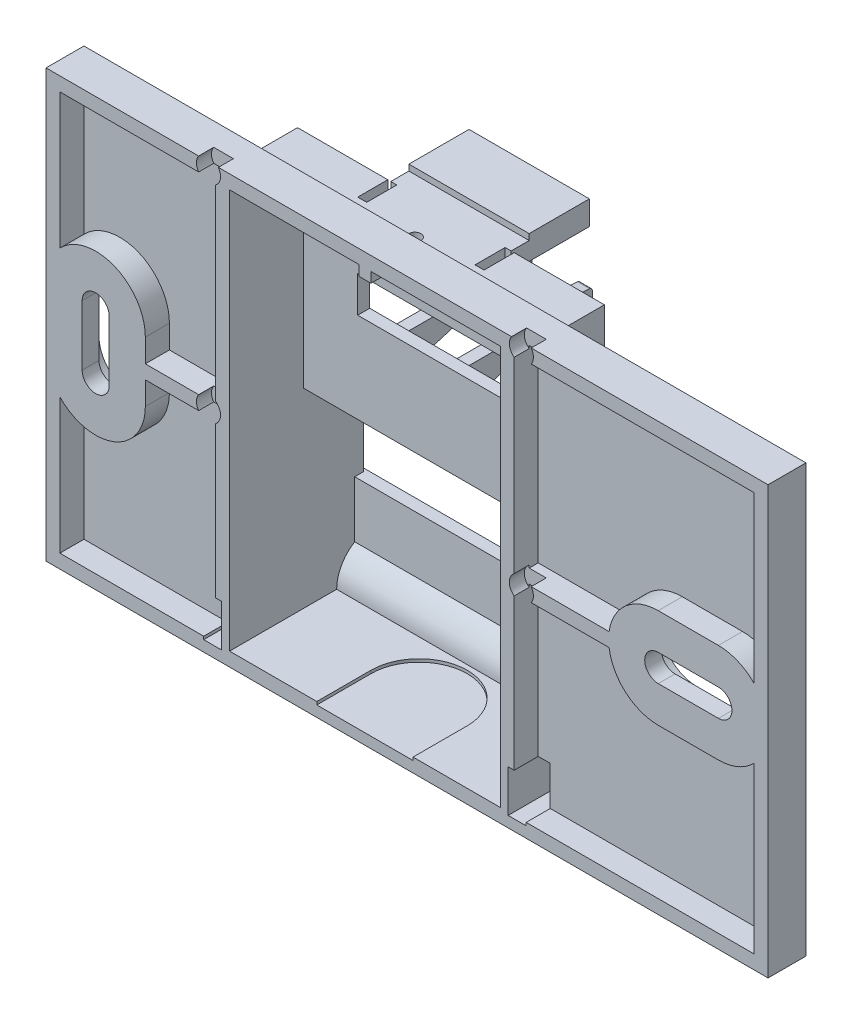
from build123d import *

# Parameters (mm, degrees)
ESQUISSE1_W                    = 120
ESQUISSE1_H                    = 71
EXTRUSION1_DEPTH               = 2.3
ESQUISSE2_W                    = 45
ESQUISSE2_H                    = 66.4
EXTRUSION2_DEPTH               = 4
ESQUISSE3_W                    = 45
ESQUISSE3_H                    = 66.4
ENL_V_MAT_EXTRU_1_DEPTH        = 98.703633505
ENL_V_MAT_EXTRU_2_DEPTH        = 3.5
ESQUISSE5_R                    = 2
ENL_V_MAT_EXTRU_3_DEPTH        = 2.5
ESQUISSE6_W                    = 51
ESQUISSE6_H                    = 69
ESQUISSE6_W_2                  = 45
ESQUISSE6_H_2                  = 64.7
EXTRUSION3_DEPTH               = 16
ESQUISSE7_W                    = 1.5
ESQUISSE7_H                    = 17
ENL_V_MAT_EXTRU_4_DEPTH        = 108.047886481
EXTRUSION4_START               = -3
EXTRUSION4_DEPTH               = 51
EXTRUSION5_REACH               = 91.323
EXTRUSION5_END_RADIUS          = 6.25
ESQUISSE9_W                    = 51
ESQUISSE9_H                    = 2
ESQUISSE10_W                   = 8
ESQUISSE10_H                   = 26.5
ENL_V_MAT_EXTRU_5_DEPTH        = 120.041112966
ESQUISSE11_W                   = 51
ESQUISSE11_H                   = 2
EXTRUSION6_DEPTH               = 33
ESQUISSE12_W                   = 27
ESQUISSE12_H                   = 6
ESQUISSE12_W_2                 = 22.5
ESQUISSE12_H_2                 = 4
ENL_V_MAT_EXTRU_6_DEPTH        = 100.258012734
ESQUISSE13_R                   = 1
ESQUISSE13_W                   = 1.5
ESQUISSE13_H                   = 5
ENL_V_MAT_EXTRU_7_DEPTH        = 3
EXTRUSION8_DEPTH               = 10
ESQUISSE15_W                   = 3
ESQUISSE15_H                   = 7
ENL_V_MAT_EXTRU_8_DEPTH        = 7
ENL_V_MAT_EXTRU_9_DEPTH        = 0.5
ESQUISSE17_W                   = 2
ESQUISSE17_H                   = 6.3
EXTRUSION9_DEPTH               = 1.7
EXTRUSION10_DEPTH              = 1
CONG_1_R                       = 0.5
R_P_TITION_LIN_AIRE1_COUNT     = 2
R_P_TITION_LIN_AIRE1_PITCH     = 10
R_P_TITION_LIN_AIRE1_COL_COUNT = 2
R_P_TITION_LIN_AIRE1_COL_PITCH = 10
CONG_2_R                       = 0.5


with BuildPart() as part:
    # Esquisse1 → Extrusion1 (new body)
    with BuildSketch(Plane.XY):
        with Locations((7, -35.5)):
            Rectangle(ESQUISSE1_W, ESQUISSE1_H)
    extrude(amount=EXTRUSION1_DEPTH)

    # Esquisse2 → Extrusion2 (add)
    with BuildSketch(Plane.XY.offset(2.3)):
        Polygon((-53, 0), (67, 0), (67, -71), (-53, -71), (-53, -30.5), align=None)
        with BuildLine():
            Line((-50.7, -2.3), (-50.7, -24.785107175))
            ThreePointArc((-50.7, -24.785107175), (-41.669821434, -22.846569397), (-36.5, -30.5))
            Line((-36.5, -30.5), (-36.5, -34.35))
            Line((-36.5, -34.35), (-24.8, -34.35))
            Line((-24.8, -34.35), (-24.8, -2.3))
            Line((-24.8, -2.3), (-50.7, -2.3))
        make_face(mode=Mode.SUBTRACT)
        with BuildLine():
            Line((-50.7, -68.7), (-24.8, -68.7))
            Line((-24.8, -68.7), (-24.8, -36.65))
            Line((-24.8, -36.65), (-36.5, -36.65))
            Line((-36.5, -36.65), (-36.5, -40.5))
            ThreePointArc((-36.5, -40.5), (-41.669821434, -48.153430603), (-50.7, -46.214892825))
            Line((-50.7, -46.214892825), (-50.7, -68.7))
        make_face(mode=Mode.SUBTRACT)
        with BuildLine():
            Line((64.7, -2.3), (64.7, -29.785107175))
            ThreePointArc((64.7, -29.785107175), (61.983777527, -27.91019217), (58.75, -27.25))
            Line((58.75, -27.25), (48.75, -27.25))
            ThreePointArc((48.75, -27.25), (43.338207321, -29.273042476), (40.580544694, -34.35))
            Line((40.580544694, -34.35), (24.8, -34.35))
            Line((24.8, -34.35), (24.8, -2.3))
            Line((24.8, -2.3), (64.7, -2.3))
        make_face(mode=Mode.SUBTRACT)
        with Locations((0, -35.5)):
            Rectangle(ESQUISSE2_W, ESQUISSE2_H, mode=Mode.SUBTRACT)
        with BuildLine():
            Line((24.8, -68.7), (64.7, -68.7))
            Line((64.7, -68.7), (64.7, -41.214892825))
            ThreePointArc((64.7, -41.214892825), (61.983777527, -43.08980783), (58.75, -43.75))
            Line((58.75, -43.75), (48.75, -43.75))
            ThreePointArc((48.75, -43.75), (43.338207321, -41.726957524), (40.580544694, -36.65))
            Line((40.580544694, -36.65), (24.8, -36.65))
            Line((24.8, -36.65), (24.8, -68.7))
        make_face(mode=Mode.SUBTRACT)
        with BuildLine():
            Line((-47, -40.5), (-47, -30.5))
            ThreePointArc((-47, -30.5), (-44.75, -28.25), (-42.5, -30.5))
            Line((-42.5, -30.5), (-42.5, -40.5))
            ThreePointArc((-42.5, -40.5), (-44.75, -42.75), (-47, -40.5))
        make_face(mode=Mode.SUBTRACT)
        with BuildLine():
            Line((48.75, -33.25), (58.75, -33.25))
            ThreePointArc((58.75, -33.25), (61, -35.5), (58.75, -37.75))
            Line((58.75, -37.75), (48.75, -37.75))
            ThreePointArc((48.75, -37.75), (46.5, -35.5), (48.75, -33.25))
        make_face(mode=Mode.SUBTRACT)
    extrude(amount=EXTRUSION2_DEPTH)

    # Esquisse3 → Enl_v. mat.-Extru.1 (cut, through all)
    with BuildSketch(Plane.XY.offset(2.3)):
        with Locations((0, -35.5)):
            Rectangle(ESQUISSE3_W, ESQUISSE3_H)
    extrude(amount=-ENL_V_MAT_EXTRU_1_DEPTH, mode=Mode.SUBTRACT)

    # Esquisse4 → Enl_v. mat.-Extru.2 (cut)
    with BuildSketch(Plane(origin=(0, 0, 0), x_dir=(-1, 0, 0), z_dir=(0, 0, -1))):
        with BuildLine():
            Line((39, -30.5), (39, -40.5))
            ThreePointArc((39, -40.5), (44.75, -46.25), (50.5, -40.5))
            Line((50.5, -40.5), (50.5, -30.5))
            ThreePointArc((50.5, -30.5), (44.75, -24.75), (39, -30.5))
        make_face()
        with BuildLine():
            Line((-48.75, -29.75), (-58.75, -29.75))
            ThreePointArc((-58.75, -29.75), (-64.5, -35.5), (-58.75, -41.25))
            Line((-58.75, -41.25), (-48.75, -41.25))
            ThreePointArc((-48.75, -41.25), (-43, -35.5), (-48.75, -29.75))
        make_face()
    extrude(amount=-ENL_V_MAT_EXTRU_2_DEPTH, mode=Mode.SUBTRACT)

    # Esquisse5 → Enl_v. mat.-Extru.3 (cut)
    with BuildSketch(Plane.XY.offset(6.3)):
        with Locations((-26, -1.15)):
            Circle(ESQUISSE5_R)
        with Locations((-26, -35.500929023)):
            Circle(ESQUISSE5_R)
        with Locations((26, -35.500929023)):
            Circle(ESQUISSE5_R)
        with Locations((26, -1.15)):
            Circle(ESQUISSE5_R)
    extrude(amount=-ENL_V_MAT_EXTRU_3_DEPTH, mode=Mode.SUBTRACT)

    # Esquisse6 → Extrusion3 (add)
    with BuildSketch(Plane(origin=(0, 0, 0), x_dir=(-1, 0, 0), z_dir=(0, 0, -1))):
        with Locations((0, -36.5)):
            Rectangle(ESQUISSE6_W, ESQUISSE6_H)
        with Locations((0, -36.35)):
            Rectangle(ESQUISSE6_W_2, ESQUISSE6_H_2, mode=Mode.SUBTRACT)
    extrude(amount=EXTRUSION3_DEPTH)

    # Esquisse7 → Enl_v. mat.-Extru.4 (cut, through all)
    with BuildSketch(Plane(origin=(25.5, 0, 0), x_dir=(0, 0, -1), z_dir=(1, 0, 0))):
        with Locations((15.25, -62.5)):
            Rectangle(ESQUISSE7_W, ESQUISSE7_H)
    extrude(amount=-ENL_V_MAT_EXTRU_4_DEPTH, mode=Mode.SUBTRACT)

    # Esquisse8 → Extrusion4 (add)
    with BuildSketch(Plane.ZY.offset(-22.5).offset(EXTRUSION4_START)):
        with BuildLine():
            Line((-23.198623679, -68.7), (-21.679058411, -68.7))
            ThreePointArc((-21.679058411, -68.7), (-21.201025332, -68.527913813), (-20.942359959, -68.090625))
            ThreePointArc((-20.942359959, -68.090625), (-17.44395251, -65.464442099), (-14.5, -68.7))
            Line((-14.5, -68.7), (-14.5, -71))
            Line((-14.5, -71), (-11.5, -71))
            Line((-11.5, -71), (-11.5, -68.7))
            ThreePointArc((-11.5, -68.7), (-17.322864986, -62.464612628), (-23.941617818, -67.847727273))
            ThreePointArc((-23.941617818, -67.847727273), (-23.763957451, -68.442846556), (-23.198623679, -68.7))
        make_face()
    extrude(amount=EXTRUSION4_DEPTH)

    # Extrusion5: up to this cylinder (the profile starts outside it)
    extrusion5_end = Plane(origin=(0, -68.7, -17.75), z_dir=(1, 0, 0)) * Cylinder(EXTRUSION5_END_RADIUS, 196.146, mode=Mode.PRIVATE)
    # Esquisse9 → Extrusion5 (add, up to the surface)
    with BuildSketch(Plane.XZ.offset(54), mode=Mode.PRIVATE) as extrusion5_sk1:
        with Locations((0, -15.5)):
            Rectangle(ESQUISSE9_W, ESQUISSE9_H)
    extrusion5_tool1 = extrude(extrusion5_sk1.sketch, amount=EXTRUSION5_REACH, mode=Mode.PRIVATE) - extrusion5_end
    add(extrusion5_tool1.solids().sort_by_distance((0, -54, -15.5))[0])

    # Esquisse10 → Enl_v. mat.-Extru.5 (cut, through all)
    with BuildSketch(Plane.ZY.offset(25.5)):
        with Locations((-12, -15.25)):
            Rectangle(ESQUISSE10_W, ESQUISSE10_H)
    extrude(amount=-ENL_V_MAT_EXTRU_5_DEPTH, mode=Mode.SUBTRACT)

    # Esquisse11 → Extrusion6 (add)
    with BuildSketch(Plane.XZ.offset(4)):
        with Locations((0, -7)):
            Rectangle(ESQUISSE11_W, ESQUISSE11_H)
    extrude(amount=EXTRUSION6_DEPTH)

    # Esquisse12 → Enl_v. mat.-Extru.6 (cut, through all)
    with BuildSketch(Plane.XY.offset(-6)):
        with Locations((0, -19)):
            Rectangle(ESQUISSE12_W, ESQUISSE12_H)
        with Locations((0, -6)):
            Rectangle(ESQUISSE12_W_2, ESQUISSE12_H_2)
    extrude(amount=-ENL_V_MAT_EXTRU_6_DEPTH, mode=Mode.SUBTRACT)

    # Esquisse13 → Enl_v. mat.-Extru.7 (cut)
    with BuildSketch(Plane(origin=(0, -2, 0), x_dir=(-1, 0, 0), z_dir=(0, 1, 0))):
        with Locations(Location((0, -2, 0), (0, 0, 90))):
            Circle(ESQUISSE13_R)
        with Locations((9.75, -5.5)):
            Rectangle(ESQUISSE13_W, ESQUISSE13_H)
        with Locations((-9.75, -5.5)):
            Rectangle(ESQUISSE13_W, ESQUISSE13_H)
    extrude(amount=-ENL_V_MAT_EXTRU_7_DEPTH, mode=Mode.SUBTRACT)

    # Esquisse14 → Extrusion8 (add, symmetric)
    with BuildSketch(Plane(origin=(0, 0, 0), x_dir=(0, 0, -1), z_dir=(1, 0, 0))):
        Polygon((8, -2), (11, -2), (11, -1), (21, -1), (21, -5), (8, -5), align=None)
    extrude(amount=EXTRUSION8_DEPTH, both=True)

    # Esquisse15 → Enl_v. mat.-Extru.8 (cut)
    with BuildSketch(Plane.XY.offset(6.3)):
        with Locations((-25.3, -65.7)):
            Rectangle(ESQUISSE15_W, ESQUISSE15_H)
        with Locations((25.3, -65.7)):
            Rectangle(ESQUISSE15_W, ESQUISSE15_H)
    extrude(amount=-ENL_V_MAT_EXTRU_8_DEPTH, mode=Mode.SUBTRACT)

    # Esquisse16 → Enl_v. mat.-Extru.9 (cut)
    with BuildSketch(Plane(origin=(0, -68.7, 0), x_dir=(-1, 0, 0), z_dir=(0, 1, 0))):
        with BuildLine():
            Line((-8, 6.3), (-8, -2.7))
            ThreePointArc((-8, -2.7), (0, -10.7), (8, -2.7))
            Line((8, -2.7), (8, 6.3))
            Line((8, 6.3), (-8, 6.3))
        make_face()
    extrude(amount=-ENL_V_MAT_EXTRU_9_DEPTH, mode=Mode.SUBTRACT)

    # Esquisse17 → Extrusion9 (add)
    with BuildSketch(Plane.XZ.offset(2.3)):
        with Locations((0, 3.15)):
            Rectangle(ESQUISSE17_W, ESQUISSE17_H)
    extrude(amount=EXTRUSION9_DEPTH)

    # Esquisse18 → Extrusion10 (add, symmetric)
    with BuildSketch(Plane(origin=(0, 0, 0), x_dir=(0, 0, -1), z_dir=(1, 0, 0))):
        with BuildLine():
            Line((8, -16), (18, -16))
            Line((18, -16), (18, -16.292893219))
            ThreePointArc((18, -16.292893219), (18.308658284, -16.754832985), (18.853553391, -16.646446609))
            Line((18.853553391, -16.646446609), (20.353553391, -15.146446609))
            ThreePointArc((20.353553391, -15.146446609), (20.461939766, -14.984234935), (20.5, -14.792893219))
            Line((20.5, -14.792893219), (20.5, -13.461597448))
            ThreePointArc((20.5, -13.461597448), (20.36738012, -13.122433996), (20.039872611, -12.963189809))
            Line((20.039872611, -12.963189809), (8, -12))
            Line((8, -12), (8, -16))
        make_face()
        with BuildLine():
            Line((8, -24), (17.5, -24))
            ThreePointArc((17.5, -24), (17.853553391, -24.146446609), (18, -24.5))
            Line((18, -24.5), (18, -26.627984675))
            ThreePointArc((18, -26.627984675), (17.901146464, -26.926449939), (17.643673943, -27.106897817))
            Line((17.643673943, -27.106897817), (8, -30))
            Line((8, -30), (8, -24))
        make_face()
    extrusion10 = extrude(amount=EXTRUSION10_DEPTH, both=True)

    # Cong_1
    cong_1_edges = [part.edges().sort_by_distance(p)[0] for p in [
        (-1, -14, -8),
        (0, -12, -8),
        (1, -14, -8),
        (-1, -27, -8),
        (0, -24, -8),
        (0, -30, -8),
        (1, -27, -8),
    ]]
    fillet(cong_1_edges, radius=CONG_1_R)

    # R_p_tition lin_aire1: Extrusion10 ×2
    with Locations(*[(-i * R_P_TITION_LIN_AIRE1_PITCH, 0, 0) for i in range(1, R_P_TITION_LIN_AIRE1_COUNT)]):
        add(extrusion10)

    # R_p_tition lin_aire1 col: Extrusion10 ×2
    with Locations(*[(i * R_P_TITION_LIN_AIRE1_COL_PITCH, 0, 0) for i in range(1, R_P_TITION_LIN_AIRE1_COL_COUNT)]):
        add(extrusion10)

    # Cong_2
    cong_2_edges = [part.edges().sort_by_distance(p)[0] for p in [
        (9, -14, -8),
        (10, -12, -8),
        (11, -14, -8),
        (9, -27, -8),
        (10, -24, -8),
        (10, -30, -8),
        (11, -27, -8),
        (-11, -14, -8),
        (-10, -12, -8),
        (-9, -14, -8),
        (-11, -27, -8),
        (-10, -24, -8),
        (-10, -30, -8),
        (-9, -27, -8),
    ]]
    fillet(cong_2_edges, radius=CONG_2_R)


solid = part.part
